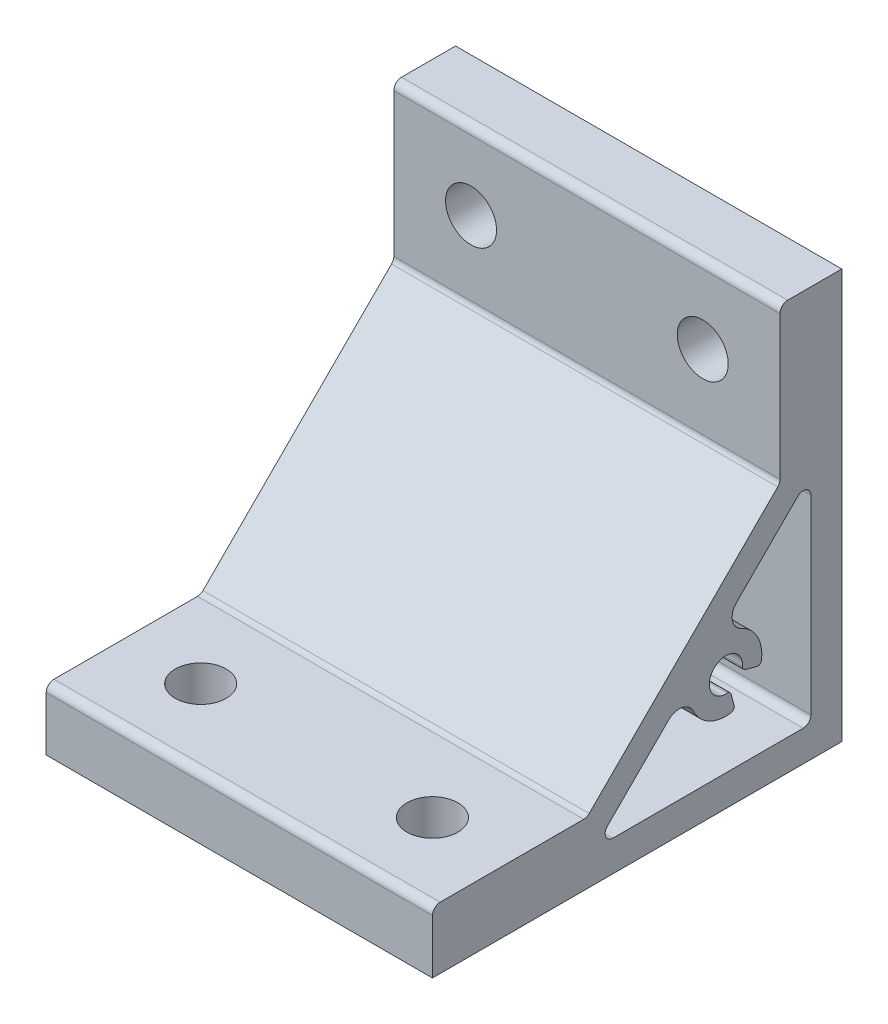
ISO-10303-21;
HEADER;
FILE_DESCRIPTION(('STEP AP214'),'2;1');
FILE_NAME('part.step','',(''),(''),'','','');
FILE_SCHEMA(('AUTOMOTIVE_DESIGN { 1 0 10303 214 1 1 1 1 }'));
ENDSEC;
DATA;
#1=APPLICATION_CONTEXT('core data for automotive mechanical design processes');
#2=APPLICATION_PROTOCOL_DEFINITION('international standard','automotive_design',2000,#1);
#3=PRODUCT_CONTEXT('',#1,'mechanical');
#4=PRODUCT('Part','Part','',(#3));
#5=PRODUCT_RELATED_PRODUCT_CATEGORY('part','',(#4));
#6=PRODUCT_DEFINITION_FORMATION('','',#4);
#7=PRODUCT_DEFINITION_CONTEXT('part definition',#1,'design');
#8=PRODUCT_DEFINITION('design','',#6,#7);
#9=PRODUCT_DEFINITION_SHAPE('','',#8);
#10=(LENGTH_UNIT() NAMED_UNIT(*) SI_UNIT(.MILLI.,.METRE.));
#11=(NAMED_UNIT(*) PLANE_ANGLE_UNIT() SI_UNIT($,.RADIAN.));
#12=(NAMED_UNIT(*) SI_UNIT($,.STERADIAN.) SOLID_ANGLE_UNIT());
#13=UNCERTAINTY_MEASURE_WITH_UNIT(LENGTH_MEASURE(1.E-05),#10,'distance_accuracy_value','');
#14=(GEOMETRIC_REPRESENTATION_CONTEXT(3) GLOBAL_UNCERTAINTY_ASSIGNED_CONTEXT((#13)) GLOBAL_UNIT_ASSIGNED_CONTEXT((#10,
#11,#12)) REPRESENTATION_CONTEXT('',''));
#15=CARTESIAN_POINT('',(0.,0.,0.));
#16=DIRECTION('',(0.,0.,1.));
#17=DIRECTION('',(1.,0.,0.));
#18=AXIS2_PLACEMENT_3D('',#15,#16,#17);
#19=CARTESIAN_POINT('',(25.,9.,33.4142135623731));
#20=DIRECTION('',(1.,0.,0.));
#21=DIRECTION('',(0.,0.,-1.));
#22=AXIS2_PLACEMENT_3D('',#19,#20,#21);
#23=PLANE('',#22);
#24=CARTESIAN_POINT('',(25.,9.,33.4142135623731));
#25=DIRECTION('',(-1.,0.,0.));
#26=DIRECTION('',(0.,0.,-1.));
#27=AXIS2_PLACEMENT_3D('',#24,#25,#26);
#28=CIRCLE('',#27,1.);
#29=CARTESIAN_POINT('',(25.,8.29289321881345,32.7071067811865));
#30=VERTEX_POINT('',#29);
#31=CARTESIAN_POINT('',(25.,8.,33.4142135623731));
#32=VERTEX_POINT('',#31);
#33=EDGE_CURVE('E364',#30,#32,#28,.T.);
#34=ORIENTED_EDGE('',*,*,#33,.T.);
#35=DIRECTION('',(0.,0.,1.));
#36=VECTOR('',#35,1.);
#37=CARTESIAN_POINT('',(25.,8.,52.));
#38=LINE('',#37,#36);
#39=CARTESIAN_POINT('',(25.,8.,52.));
#40=VERTEX_POINT('',#39);
#41=EDGE_CURVE('E367',#32,#40,#38,.T.);
#42=ORIENTED_EDGE('',*,*,#41,.T.);
#43=CARTESIAN_POINT('',(25.,7.,52.));
#44=DIRECTION('',(1.,0.,0.));
#45=DIRECTION('',(0.,0.,-1.));
#46=AXIS2_PLACEMENT_3D('',#43,#44,#45);
#47=CIRCLE('',#46,0.999999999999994);
#48=CARTESIAN_POINT('',(25.,7.,53.));
#49=VERTEX_POINT('',#48);
#50=EDGE_CURVE('E370',#40,#49,#47,.T.);
#51=ORIENTED_EDGE('',*,*,#50,.T.);
#52=DIRECTION('',(0.,-1.,0.));
#53=VECTOR('',#52,1.);
#54=CARTESIAN_POINT('',(25.,0.,53.));
#55=LINE('',#54,#53);
#56=CARTESIAN_POINT('',(25.,0.,53.));
#57=VERTEX_POINT('',#56);
#58=EDGE_CURVE('E372',#49,#57,#55,.T.);
#59=ORIENTED_EDGE('',*,*,#58,.T.);
#60=DIRECTION('',(0.,0.,-1.));
#61=VECTOR('',#60,1.);
#62=CARTESIAN_POINT('',(25.,0.,53.));
#63=LINE('',#62,#61);
#64=CARTESIAN_POINT('',(25.,0.,0.));
#65=VERTEX_POINT('',#64);
#66=EDGE_CURVE('E374',#57,#65,#63,.T.);
#67=ORIENTED_EDGE('',*,*,#66,.T.);
#68=DIRECTION('',(0.,1.,0.));
#69=VECTOR('',#68,1.);
#70=CARTESIAN_POINT('',(25.,0.,0.));
#71=LINE('',#70,#69);
#72=CARTESIAN_POINT('',(25.,53.,0.));
#73=VERTEX_POINT('',#72);
#74=EDGE_CURVE('E376',#65,#73,#71,.T.);
#75=ORIENTED_EDGE('',*,*,#74,.T.);
#76=DIRECTION('',(0.,0.,1.));
#77=VECTOR('',#76,1.);
#78=CARTESIAN_POINT('',(25.,53.,6.99999999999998));
#79=LINE('',#78,#77);
#80=CARTESIAN_POINT('',(25.,53.,6.99999999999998));
#81=VERTEX_POINT('',#80);
#82=EDGE_CURVE('E378',#73,#81,#79,.T.);
#83=ORIENTED_EDGE('',*,*,#82,.T.);
#84=CARTESIAN_POINT('',(25.,52.,6.99999999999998));
#85=DIRECTION('',(1.,0.,0.));
#86=DIRECTION('',(0.,0.,-1.));
#87=AXIS2_PLACEMENT_3D('',#84,#85,#86);
#88=CIRCLE('',#87,1.);
#89=CARTESIAN_POINT('',(25.,52.,7.99999999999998));
#90=VERTEX_POINT('',#89);
#91=EDGE_CURVE('E380',#81,#90,#88,.T.);
#92=ORIENTED_EDGE('',*,*,#91,.T.);
#93=DIRECTION('',(0.,-1.,0.));
#94=VECTOR('',#93,1.);
#95=CARTESIAN_POINT('',(25.,33.4142135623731,7.99999999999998));
#96=LINE('',#95,#94);
#97=CARTESIAN_POINT('',(25.,33.4142135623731,7.99999999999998));
#98=VERTEX_POINT('',#97);
#99=EDGE_CURVE('E382',#90,#98,#96,.T.);
#100=ORIENTED_EDGE('',*,*,#99,.T.);
#101=CARTESIAN_POINT('',(25.,33.4142135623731,8.99999999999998));
#102=DIRECTION('',(-1.,0.,0.));
#103=DIRECTION('',(0.,0.,-1.));
#104=AXIS2_PLACEMENT_3D('',#101,#102,#103);
#105=CIRCLE('',#104,0.999999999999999);
#106=CARTESIAN_POINT('',(25.,32.7071067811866,8.29289321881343));
#107=VERTEX_POINT('',#106);
#108=EDGE_CURVE('E384',#98,#107,#105,.T.);
#109=ORIENTED_EDGE('',*,*,#108,.T.);
#110=DIRECTION('',(0.,-0.707106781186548,0.707106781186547));
#111=VECTOR('',#110,1.);
#112=CARTESIAN_POINT('',(25.,32.7071067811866,8.29289321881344));
#113=LINE('',#112,#111);
#114=EDGE_CURVE('E386',#107,#30,#113,.T.);
#115=ORIENTED_EDGE('',*,*,#114,.T.);
#116=EDGE_LOOP('',(#34,#42,#51,#59,#67,#75,#83,#92,#100,#109,#115));
#117=FACE_BOUND('',#116,.T.);
#118=DIRECTION('',(0.,-0.707106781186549,0.707106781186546));
#119=VECTOR('',#118,1.);
#120=CARTESIAN_POINT('',(25.,13.6074107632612,22.442841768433));
#121=LINE('',#120,#119);
#122=CARTESIAN_POINT('',(25.,13.6074107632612,22.442841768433));
#123=VERTEX_POINT('',#122);
#124=CARTESIAN_POINT('',(25.,5.70710678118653,30.3431457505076));
#125=VERTEX_POINT('',#124);
#126=EDGE_CURVE('E235',#123,#125,#121,.T.);
#127=ORIENTED_EDGE('',*,*,#126,.F.);
#128=CARTESIAN_POINT('',(25.,12.1931972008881,21.0286282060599));
#129=DIRECTION('',(1.,0.,0.));
#130=DIRECTION('',(0.,0.,-1.));
#131=AXIS2_PLACEMENT_3D('',#128,#129,#130);
#132=CIRCLE('',#131,2.00000000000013);
#133=CARTESIAN_POINT('',(25.,13.0373484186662,19.2155069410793));
#134=VERTEX_POINT('',#133);
#135=EDGE_CURVE('E227',#134,#123,#132,.T.);
#136=ORIENTED_EDGE('',*,*,#135,.F.);
#137=CARTESIAN_POINT('',(25.,15.,15.));
#138=DIRECTION('',(-1.,0.,0.));
#139=DIRECTION('',(0.,0.,-1.));
#140=AXIS2_PLACEMENT_3D('',#137,#138,#139);
#141=CIRCLE('',#140,4.65);
#142=CARTESIAN_POINT('',(25.,10.3961625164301,14.3464095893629));
#143=VERTEX_POINT('',#142);
#144=EDGE_CURVE('E281',#143,#134,#141,.T.);
#145=ORIENTED_EDGE('',*,*,#144,.F.);
#146=CARTESIAN_POINT('',(25.,10.891198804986,14.4166881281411));
#147=DIRECTION('',(-1.,0.,0.));
#148=DIRECTION('',(0.,0.,-1.));
#149=AXIS2_PLACEMENT_3D('',#146,#147,#148);
#150=CIRCLE('',#149,0.500000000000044);
#151=CARTESIAN_POINT('',(25.,11.0206083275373,13.9337252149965));
#152=VERTEX_POINT('',#151);
#153=EDGE_CURVE('E279',#152,#143,#150,.T.);
#154=ORIENTED_EDGE('',*,*,#153,.F.);
#155=DIRECTION('',(0.,-0.965925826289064,-0.258819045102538));
#156=VECTOR('',#155,1.);
#157=CARTESIAN_POINT('',(25.,11.0206083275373,13.9337252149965));
#158=LINE('',#157,#156);
#159=CARTESIAN_POINT('',(25.,12.4862719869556,14.3264486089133));
#160=VERTEX_POINT('',#159);
#161=EDGE_CURVE('E277',#160,#152,#158,.T.);
#162=ORIENTED_EDGE('',*,*,#161,.F.);
#163=CARTESIAN_POINT('',(25.,12.3568624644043,14.8094115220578));
#164=DIRECTION('',(-1.,0.,0.));
#165=DIRECTION('',(0.,0.,-1.));
#166=AXIS2_PLACEMENT_3D('',#163,#164,#165);
#167=CIRCLE('',#166,0.499999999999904);
#168=CARTESIAN_POINT('',(25.,12.8555676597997,14.8453716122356));
#169=VERTEX_POINT('',#168);
#170=EDGE_CURVE('E275',#169,#160,#167,.T.);
#171=ORIENTED_EDGE('',*,*,#170,.F.);
#172=CARTESIAN_POINT('',(25.,15.,15.));
#173=DIRECTION('',(1.,0.,0.));
#174=DIRECTION('',(0.,0.,-1.));
#175=AXIS2_PLACEMENT_3D('',#172,#173,#174);
#176=CIRCLE('',#175,2.15);
#177=CARTESIAN_POINT('',(25.,14.8453716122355,12.8555676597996));
#178=VERTEX_POINT('',#177);
#179=EDGE_CURVE('E273',#178,#169,#176,.T.);
#180=ORIENTED_EDGE('',*,*,#179,.F.);
#181=CARTESIAN_POINT('',(25.,14.8094115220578,12.3568624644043));
#182=DIRECTION('',(-1.,0.,0.));
#183=DIRECTION('',(0.,0.,-1.));
#184=AXIS2_PLACEMENT_3D('',#181,#182,#183);
#185=CIRCLE('',#184,0.499999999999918);
#186=CARTESIAN_POINT('',(25.,14.3264486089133,12.4862719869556));
#187=VERTEX_POINT('',#186);
#188=EDGE_CURVE('E271',#187,#178,#185,.T.);
#189=ORIENTED_EDGE('',*,*,#188,.F.);
#190=DIRECTION('',(0.,0.258819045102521,0.965925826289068));
#191=VECTOR('',#190,1.);
#192=CARTESIAN_POINT('',(25.,13.9337252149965,11.0206083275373));
#193=LINE('',#192,#191);
#194=CARTESIAN_POINT('',(25.,13.9337252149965,11.0206083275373));
#195=VERTEX_POINT('',#194);
#196=EDGE_CURVE('E269',#195,#187,#193,.T.);
#197=ORIENTED_EDGE('',*,*,#196,.F.);
#198=CARTESIAN_POINT('',(25.,14.416688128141,10.891198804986));
#199=DIRECTION('',(-1.,0.,0.));
#200=DIRECTION('',(0.,0.,-1.));
#201=AXIS2_PLACEMENT_3D('',#198,#199,#200);
#202=CIRCLE('',#201,0.499999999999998);
#203=CARTESIAN_POINT('',(25.,14.3464095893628,10.3961625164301));
#204=VERTEX_POINT('',#203);
#205=EDGE_CURVE('E267',#204,#195,#202,.T.);
#206=ORIENTED_EDGE('',*,*,#205,.F.);
#207=CARTESIAN_POINT('',(25.,15.,15.));
#208=DIRECTION('',(-1.,0.,0.));
#209=DIRECTION('',(0.,0.,-1.));
#210=AXIS2_PLACEMENT_3D('',#207,#208,#209);
#211=CIRCLE('',#210,4.65000000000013);
#212=CARTESIAN_POINT('',(25.,19.2155069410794,13.0373484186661));
#213=VERTEX_POINT('',#212);
#214=EDGE_CURVE('E265',#213,#204,#211,.T.);
#215=ORIENTED_EDGE('',*,*,#214,.F.);
#216=CARTESIAN_POINT('',(25.,21.0286282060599,12.1931972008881));
#217=DIRECTION('',(1.,0.,0.));
#218=DIRECTION('',(0.,0.,-1.));
#219=AXIS2_PLACEMENT_3D('',#216,#217,#218);
#220=CIRCLE('',#219,1.99999999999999);
#221=CARTESIAN_POINT('',(25.,22.442841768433,13.6074107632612));
#222=VERTEX_POINT('',#221);
#223=EDGE_CURVE('E263',#222,#213,#220,.T.);
#224=ORIENTED_EDGE('',*,*,#223,.F.);
#225=DIRECTION('',(0.,-0.707106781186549,0.707106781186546));
#226=VECTOR('',#225,1.);
#227=CARTESIAN_POINT('',(25.,30.3431457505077,5.70710678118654));
#228=LINE('',#227,#226);
#229=CARTESIAN_POINT('',(25.,30.3431457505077,5.70710678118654));
#230=VERTEX_POINT('',#229);
#231=EDGE_CURVE('E261',#230,#222,#228,.T.);
#232=ORIENTED_EDGE('',*,*,#231,.F.);
#233=CARTESIAN_POINT('',(25.,29.6360389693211,4.99999999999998));
#234=DIRECTION('',(1.,0.,0.));
#235=DIRECTION('',(0.,0.,-1.));
#236=AXIS2_PLACEMENT_3D('',#233,#234,#235);
#237=CIRCLE('',#236,1.00000000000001);
#238=CARTESIAN_POINT('',(25.,29.6360389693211,3.99999999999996));
#239=VERTEX_POINT('',#238);
#240=EDGE_CURVE('E259',#239,#230,#237,.T.);
#241=ORIENTED_EDGE('',*,*,#240,.F.);
#242=DIRECTION('',(0.,1.,0.));
#243=VECTOR('',#242,1.);
#244=CARTESIAN_POINT('',(25.,4.99999999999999,3.99999999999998));
#245=LINE('',#244,#243);
#246=CARTESIAN_POINT('',(25.,4.99999999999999,3.99999999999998));
#247=VERTEX_POINT('',#246);
#248=EDGE_CURVE('E257',#247,#239,#245,.T.);
#249=ORIENTED_EDGE('',*,*,#248,.F.);
#250=CARTESIAN_POINT('',(25.,4.99999999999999,4.99999999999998));
#251=DIRECTION('',(1.,0.,0.));
#252=DIRECTION('',(0.,0.,-1.));
#253=AXIS2_PLACEMENT_3D('',#250,#251,#252);
#254=CIRCLE('',#253,1.);
#255=CARTESIAN_POINT('',(25.,3.99999999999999,4.99999999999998));
#256=VERTEX_POINT('',#255);
#257=EDGE_CURVE('E255',#256,#247,#254,.T.);
#258=ORIENTED_EDGE('',*,*,#257,.F.);
#259=DIRECTION('',(0.,0.,-1.));
#260=VECTOR('',#259,1.);
#261=CARTESIAN_POINT('',(25.,3.99999999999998,29.6360389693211));
#262=LINE('',#261,#260);
#263=CARTESIAN_POINT('',(25.,3.99999999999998,29.6360389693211));
#264=VERTEX_POINT('',#263);
#265=EDGE_CURVE('E250',#264,#256,#262,.T.);
#266=ORIENTED_EDGE('',*,*,#265,.F.);
#267=CARTESIAN_POINT('',(25.,4.99999999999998,29.6360389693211));
#268=DIRECTION('',(1.,0.,0.));
#269=DIRECTION('',(0.,0.,-1.));
#270=AXIS2_PLACEMENT_3D('',#267,#268,#269);
#271=CIRCLE('',#270,0.999999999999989);
#272=EDGE_CURVE('E248',#125,#264,#271,.T.);
#273=ORIENTED_EDGE('',*,*,#272,.F.);
#274=EDGE_LOOP('',(#127,#136,#145,#154,#162,#171,#180,#189,#197,#206,#215,#224,#232,#241,#249,
#258,#266,#273));
#275=FACE_BOUND('',#274,.T.);
#276=ADVANCED_FACE('F36',(#117,#275),#23,.T.);
#277=CARTESIAN_POINT('',(-25.,9.,33.4142135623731));
#278=DIRECTION('',(1.,0.,0.));
#279=DIRECTION('',(0.,0.,-1.));
#280=AXIS2_PLACEMENT_3D('',#277,#278,#279);
#281=PLANE('',#280);
#282=CARTESIAN_POINT('',(-25.,9.,33.4142135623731));
#283=DIRECTION('',(-1.,0.,0.));
#284=DIRECTION('',(0.,0.,-1.));
#285=AXIS2_PLACEMENT_3D('',#282,#283,#284);
#286=CIRCLE('',#285,1.);
#287=CARTESIAN_POINT('',(-25.,8.29289321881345,32.7071067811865));
#288=VERTEX_POINT('',#287);
#289=CARTESIAN_POINT('',(-25.,8.,33.4142135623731));
#290=VERTEX_POINT('',#289);
#291=EDGE_CURVE('E243',#288,#290,#286,.T.);
#292=ORIENTED_EDGE('',*,*,#291,.F.);
#293=DIRECTION('',(0.,-0.707106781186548,0.707106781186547));
#294=VECTOR('',#293,1.);
#295=CARTESIAN_POINT('',(-25.,32.7071067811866,8.29289321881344));
#296=LINE('',#295,#294);
#297=CARTESIAN_POINT('',(-25.,32.7071067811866,8.29289321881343));
#298=VERTEX_POINT('',#297);
#299=EDGE_CURVE('E368',#298,#288,#296,.T.);
#300=ORIENTED_EDGE('',*,*,#299,.F.);
#301=CARTESIAN_POINT('',(-25.,33.4142135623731,8.99999999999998));
#302=DIRECTION('',(-1.,0.,0.));
#303=DIRECTION('',(0.,0.,-1.));
#304=AXIS2_PLACEMENT_3D('',#301,#302,#303);
#305=CIRCLE('',#304,0.999999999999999);
#306=CARTESIAN_POINT('',(-25.,33.4142135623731,7.99999999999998));
#307=VERTEX_POINT('',#306);
#308=EDGE_CURVE('E407',#307,#298,#305,.T.);
#309=ORIENTED_EDGE('',*,*,#308,.F.);
#310=DIRECTION('',(0.,-1.,0.));
#311=VECTOR('',#310,1.);
#312=CARTESIAN_POINT('',(-25.,33.4142135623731,7.99999999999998));
#313=LINE('',#312,#311);
#314=CARTESIAN_POINT('',(-25.,52.,7.99999999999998));
#315=VERTEX_POINT('',#314);
#316=EDGE_CURVE('E405',#315,#307,#313,.T.);
#317=ORIENTED_EDGE('',*,*,#316,.F.);
#318=CARTESIAN_POINT('',(-25.,52.,6.99999999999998));
#319=DIRECTION('',(1.,0.,0.));
#320=DIRECTION('',(0.,0.,-1.));
#321=AXIS2_PLACEMENT_3D('',#318,#319,#320);
#322=CIRCLE('',#321,1.);
#323=CARTESIAN_POINT('',(-25.,53.,6.99999999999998));
#324=VERTEX_POINT('',#323);
#325=EDGE_CURVE('E403',#324,#315,#322,.T.);
#326=ORIENTED_EDGE('',*,*,#325,.F.);
#327=DIRECTION('',(0.,0.,1.));
#328=VECTOR('',#327,1.);
#329=CARTESIAN_POINT('',(-25.,53.,6.99999999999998));
#330=LINE('',#329,#328);
#331=CARTESIAN_POINT('',(-25.,53.,0.));
#332=VERTEX_POINT('',#331);
#333=EDGE_CURVE('E401',#332,#324,#330,.T.);
#334=ORIENTED_EDGE('',*,*,#333,.F.);
#335=DIRECTION('',(0.,1.,0.));
#336=VECTOR('',#335,1.);
#337=CARTESIAN_POINT('',(-25.,0.,0.));
#338=LINE('',#337,#336);
#339=CARTESIAN_POINT('',(-25.,0.,0.));
#340=VERTEX_POINT('',#339);
#341=EDGE_CURVE('E399',#340,#332,#338,.T.);
#342=ORIENTED_EDGE('',*,*,#341,.F.);
#343=DIRECTION('',(0.,0.,-1.));
#344=VECTOR('',#343,1.);
#345=CARTESIAN_POINT('',(-25.,0.,53.));
#346=LINE('',#345,#344);
#347=CARTESIAN_POINT('',(-25.,0.,53.));
#348=VERTEX_POINT('',#347);
#349=EDGE_CURVE('E397',#348,#340,#346,.T.);
#350=ORIENTED_EDGE('',*,*,#349,.F.);
#351=DIRECTION('',(0.,-1.,0.));
#352=VECTOR('',#351,1.);
#353=CARTESIAN_POINT('',(-25.,0.,53.));
#354=LINE('',#353,#352);
#355=CARTESIAN_POINT('',(-25.,7.,53.));
#356=VERTEX_POINT('',#355);
#357=EDGE_CURVE('E395',#356,#348,#354,.T.);
#358=ORIENTED_EDGE('',*,*,#357,.F.);
#359=CARTESIAN_POINT('',(-25.,7.,52.));
#360=DIRECTION('',(1.,0.,0.));
#361=DIRECTION('',(0.,0.,-1.));
#362=AXIS2_PLACEMENT_3D('',#359,#360,#361);
#363=CIRCLE('',#362,0.999999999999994);
#364=CARTESIAN_POINT('',(-25.,8.,52.));
#365=VERTEX_POINT('',#364);
#366=EDGE_CURVE('E393',#365,#356,#363,.T.);
#367=ORIENTED_EDGE('',*,*,#366,.F.);
#368=DIRECTION('',(0.,0.,1.));
#369=VECTOR('',#368,1.);
#370=CARTESIAN_POINT('',(-25.,8.,52.));
#371=LINE('',#370,#369);
#372=EDGE_CURVE('E391',#290,#365,#371,.T.);
#373=ORIENTED_EDGE('',*,*,#372,.F.);
#374=EDGE_LOOP('',(#292,#300,#309,#317,#326,#334,#342,#350,#358,#367,#373));
#375=FACE_BOUND('',#374,.T.);
#376=CARTESIAN_POINT('',(-25.,12.1931972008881,21.0286282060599));
#377=DIRECTION('',(1.,0.,0.));
#378=DIRECTION('',(0.,0.,-1.));
#379=AXIS2_PLACEMENT_3D('',#376,#377,#378);
#380=CIRCLE('',#379,2.00000000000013);
#381=CARTESIAN_POINT('',(-25.,13.0373484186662,19.2155069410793));
#382=VERTEX_POINT('',#381);
#383=CARTESIAN_POINT('',(-25.,13.6074107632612,22.442841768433));
#384=VERTEX_POINT('',#383);
#385=EDGE_CURVE('E59',#382,#384,#380,.T.);
#386=ORIENTED_EDGE('',*,*,#385,.T.);
#387=DIRECTION('',(0.,-0.707106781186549,0.707106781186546));
#388=VECTOR('',#387,1.);
#389=CARTESIAN_POINT('',(-25.,13.6074107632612,22.442841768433));
#390=LINE('',#389,#388);
#391=CARTESIAN_POINT('',(-25.,5.70710678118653,30.3431457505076));
#392=VERTEX_POINT('',#391);
#393=EDGE_CURVE('E242',#384,#392,#390,.T.);
#394=ORIENTED_EDGE('',*,*,#393,.T.);
#395=CARTESIAN_POINT('',(-25.,4.99999999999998,29.6360389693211));
#396=DIRECTION('',(1.,0.,0.));
#397=DIRECTION('',(0.,0.,-1.));
#398=AXIS2_PLACEMENT_3D('',#395,#396,#397);
#399=CIRCLE('',#398,0.999999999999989);
#400=CARTESIAN_POINT('',(-25.,3.99999999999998,29.6360389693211));
#401=VERTEX_POINT('',#400);
#402=EDGE_CURVE('E286',#392,#401,#399,.T.);
#403=ORIENTED_EDGE('',*,*,#402,.T.);
#404=DIRECTION('',(0.,0.,-1.));
#405=VECTOR('',#404,1.);
#406=CARTESIAN_POINT('',(-25.,3.99999999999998,29.6360389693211));
#407=LINE('',#406,#405);
#408=CARTESIAN_POINT('',(-25.,3.99999999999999,4.99999999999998));
#409=VERTEX_POINT('',#408);
#410=EDGE_CURVE('E289',#401,#409,#407,.T.);
#411=ORIENTED_EDGE('',*,*,#410,.T.);
#412=CARTESIAN_POINT('',(-25.,4.99999999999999,4.99999999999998));
#413=DIRECTION('',(1.,0.,0.));
#414=DIRECTION('',(0.,0.,-1.));
#415=AXIS2_PLACEMENT_3D('',#412,#413,#414);
#416=CIRCLE('',#415,1.);
#417=CARTESIAN_POINT('',(-25.,4.99999999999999,3.99999999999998));
#418=VERTEX_POINT('',#417);
#419=EDGE_CURVE('E292',#409,#418,#416,.T.);
#420=ORIENTED_EDGE('',*,*,#419,.T.);
#421=DIRECTION('',(0.,1.,0.));
#422=VECTOR('',#421,1.);
#423=CARTESIAN_POINT('',(-25.,4.99999999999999,3.99999999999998));
#424=LINE('',#423,#422);
#425=CARTESIAN_POINT('',(-25.,29.6360389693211,3.99999999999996));
#426=VERTEX_POINT('',#425);
#427=EDGE_CURVE('E295',#418,#426,#424,.T.);
#428=ORIENTED_EDGE('',*,*,#427,.T.);
#429=CARTESIAN_POINT('',(-25.,29.6360389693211,4.99999999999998));
#430=DIRECTION('',(1.,0.,0.));
#431=DIRECTION('',(0.,0.,-1.));
#432=AXIS2_PLACEMENT_3D('',#429,#430,#431);
#433=CIRCLE('',#432,1.00000000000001);
#434=CARTESIAN_POINT('',(-25.,30.3431457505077,5.70710678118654));
#435=VERTEX_POINT('',#434);
#436=EDGE_CURVE('E298',#426,#435,#433,.T.);
#437=ORIENTED_EDGE('',*,*,#436,.T.);
#438=DIRECTION('',(0.,-0.707106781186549,0.707106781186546));
#439=VECTOR('',#438,1.);
#440=CARTESIAN_POINT('',(-25.,30.3431457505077,5.70710678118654));
#441=LINE('',#440,#439);
#442=CARTESIAN_POINT('',(-25.,22.442841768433,13.6074107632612));
#443=VERTEX_POINT('',#442);
#444=EDGE_CURVE('E301',#435,#443,#441,.T.);
#445=ORIENTED_EDGE('',*,*,#444,.T.);
#446=CARTESIAN_POINT('',(-25.,21.0286282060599,12.1931972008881));
#447=DIRECTION('',(1.,0.,0.));
#448=DIRECTION('',(0.,0.,-1.));
#449=AXIS2_PLACEMENT_3D('',#446,#447,#448);
#450=CIRCLE('',#449,1.99999999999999);
#451=CARTESIAN_POINT('',(-25.,19.2155069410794,13.0373484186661));
#452=VERTEX_POINT('',#451);
#453=EDGE_CURVE('E304',#443,#452,#450,.T.);
#454=ORIENTED_EDGE('',*,*,#453,.T.);
#455=CARTESIAN_POINT('',(-25.,15.,15.));
#456=DIRECTION('',(-1.,0.,0.));
#457=DIRECTION('',(0.,0.,-1.));
#458=AXIS2_PLACEMENT_3D('',#455,#456,#457);
#459=CIRCLE('',#458,4.65000000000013);
#460=CARTESIAN_POINT('',(-25.,14.3464095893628,10.3961625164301));
#461=VERTEX_POINT('',#460);
#462=EDGE_CURVE('E307',#452,#461,#459,.T.);
#463=ORIENTED_EDGE('',*,*,#462,.T.);
#464=CARTESIAN_POINT('',(-25.,14.416688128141,10.891198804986));
#465=DIRECTION('',(-1.,0.,0.));
#466=DIRECTION('',(0.,0.,-1.));
#467=AXIS2_PLACEMENT_3D('',#464,#465,#466);
#468=CIRCLE('',#467,0.499999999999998);
#469=CARTESIAN_POINT('',(-25.,13.9337252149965,11.0206083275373));
#470=VERTEX_POINT('',#469);
#471=EDGE_CURVE('E310',#461,#470,#468,.T.);
#472=ORIENTED_EDGE('',*,*,#471,.T.);
#473=DIRECTION('',(0.,0.258819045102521,0.965925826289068));
#474=VECTOR('',#473,1.);
#475=CARTESIAN_POINT('',(-25.,13.9337252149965,11.0206083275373));
#476=LINE('',#475,#474);
#477=CARTESIAN_POINT('',(-25.,14.3264486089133,12.4862719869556));
#478=VERTEX_POINT('',#477);
#479=EDGE_CURVE('E313',#470,#478,#476,.T.);
#480=ORIENTED_EDGE('',*,*,#479,.T.);
#481=CARTESIAN_POINT('',(-25.,14.8094115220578,12.3568624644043));
#482=DIRECTION('',(-1.,0.,0.));
#483=DIRECTION('',(0.,0.,-1.));
#484=AXIS2_PLACEMENT_3D('',#481,#482,#483);
#485=CIRCLE('',#484,0.499999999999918);
#486=CARTESIAN_POINT('',(-25.,14.8453716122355,12.8555676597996));
#487=VERTEX_POINT('',#486);
#488=EDGE_CURVE('E316',#478,#487,#485,.T.);
#489=ORIENTED_EDGE('',*,*,#488,.T.);
#490=CARTESIAN_POINT('',(-25.,15.,15.));
#491=DIRECTION('',(1.,0.,0.));
#492=DIRECTION('',(0.,0.,-1.));
#493=AXIS2_PLACEMENT_3D('',#490,#491,#492);
#494=CIRCLE('',#493,2.15);
#495=CARTESIAN_POINT('',(-25.,12.8555676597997,14.8453716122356));
#496=VERTEX_POINT('',#495);
#497=EDGE_CURVE('E319',#487,#496,#494,.T.);
#498=ORIENTED_EDGE('',*,*,#497,.T.);
#499=CARTESIAN_POINT('',(-25.,12.3568624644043,14.8094115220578));
#500=DIRECTION('',(-1.,0.,0.));
#501=DIRECTION('',(0.,0.,-1.));
#502=AXIS2_PLACEMENT_3D('',#499,#500,#501);
#503=CIRCLE('',#502,0.499999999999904);
#504=CARTESIAN_POINT('',(-25.,12.4862719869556,14.3264486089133));
#505=VERTEX_POINT('',#504);
#506=EDGE_CURVE('E322',#496,#505,#503,.T.);
#507=ORIENTED_EDGE('',*,*,#506,.T.);
#508=DIRECTION('',(0.,-0.965925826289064,-0.258819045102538));
#509=VECTOR('',#508,1.);
#510=CARTESIAN_POINT('',(-25.,11.0206083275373,13.9337252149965));
#511=LINE('',#510,#509);
#512=CARTESIAN_POINT('',(-25.,11.0206083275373,13.9337252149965));
#513=VERTEX_POINT('',#512);
#514=EDGE_CURVE('E325',#505,#513,#511,.T.);
#515=ORIENTED_EDGE('',*,*,#514,.T.);
#516=CARTESIAN_POINT('',(-25.,10.891198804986,14.4166881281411));
#517=DIRECTION('',(-1.,0.,0.));
#518=DIRECTION('',(0.,0.,-1.));
#519=AXIS2_PLACEMENT_3D('',#516,#517,#518);
#520=CIRCLE('',#519,0.500000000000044);
#521=CARTESIAN_POINT('',(-25.,10.3961625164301,14.3464095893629));
#522=VERTEX_POINT('',#521);
#523=EDGE_CURVE('E328',#513,#522,#520,.T.);
#524=ORIENTED_EDGE('',*,*,#523,.T.);
#525=CARTESIAN_POINT('',(-25.,15.,15.));
#526=DIRECTION('',(-1.,0.,0.));
#527=DIRECTION('',(0.,0.,-1.));
#528=AXIS2_PLACEMENT_3D('',#525,#526,#527);
#529=CIRCLE('',#528,4.65);
#530=EDGE_CURVE('E236',#522,#382,#529,.T.);
#531=ORIENTED_EDGE('',*,*,#530,.T.);
#532=EDGE_LOOP('',(#386,#394,#403,#411,#420,#428,#437,#445,#454,#463,#472,#480,#489,#498,#507,
#515,#524,#531));
#533=FACE_BOUND('',#532,.T.);
#534=ADVANCED_FACE('F446',(#375,#533),#281,.F.);
#535=CARTESIAN_POINT('',(25.,9.,33.4142135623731));
#536=DIRECTION('',(-1.,0.,0.));
#537=DIRECTION('',(0.,0.,1.));
#538=AXIS2_PLACEMENT_3D('',#535,#536,#537);
#539=CYLINDRICAL_SURFACE('',#538,1.);
#540=ORIENTED_EDGE('',*,*,#291,.T.);
#541=DIRECTION('',(-1.,0.,0.));
#542=VECTOR('',#541,1.);
#543=CARTESIAN_POINT('',(25.,8.,33.4142135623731));
#544=LINE('',#543,#542);
#545=EDGE_CURVE('E11',#32,#290,#544,.T.);
#546=ORIENTED_EDGE('',*,*,#545,.F.);
#547=ORIENTED_EDGE('',*,*,#33,.F.);
#548=DIRECTION('',(-1.,0.,0.));
#549=VECTOR('',#548,1.);
#550=CARTESIAN_POINT('',(25.,8.29289321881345,32.7071067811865));
#551=LINE('',#550,#549);
#552=EDGE_CURVE('E388',#30,#288,#551,.T.);
#553=ORIENTED_EDGE('',*,*,#552,.T.);
#554=EDGE_LOOP('',(#540,#546,#547,#553));
#555=FACE_BOUND('',#554,.T.);
#556=ADVANCED_FACE('F38',(#555),#539,.F.);
#557=CARTESIAN_POINT('',(25.,8.,52.));
#558=DIRECTION('',(0.,-1.,0.));
#559=DIRECTION('',(0.,0.,-1.));
#560=AXIS2_PLACEMENT_3D('',#557,#558,#559);
#561=PLANE('',#560);
#562=CARTESIAN_POINT('',(-15.,8.,43.));
#563=DIRECTION('',(0.,1.,0.));
#564=DIRECTION('',(0.,0.,1.));
#565=AXIS2_PLACEMENT_3D('',#562,#563,#564);
#566=CIRCLE('',#565,3.3);
#567=CARTESIAN_POINT('',(-15.,8.,46.3));
#568=VERTEX_POINT('',#567);
#569=EDGE_CURVE('E818',#568,#568,#566,.T.);
#570=ORIENTED_EDGE('',*,*,#569,.F.);
#571=EDGE_LOOP('',(#570));
#572=FACE_BOUND('',#571,.T.);
#573=CARTESIAN_POINT('',(15.,8.,43.));
#574=DIRECTION('',(0.,1.,0.));
#575=DIRECTION('',(0.,0.,1.));
#576=AXIS2_PLACEMENT_3D('',#573,#574,#575);
#577=CIRCLE('',#576,3.3);
#578=CARTESIAN_POINT('',(15.,8.,46.3));
#579=VERTEX_POINT('',#578);
#580=EDGE_CURVE('E821',#579,#579,#577,.T.);
#581=ORIENTED_EDGE('',*,*,#580,.F.);
#582=EDGE_LOOP('',(#581));
#583=FACE_BOUND('',#582,.T.);
#584=ORIENTED_EDGE('',*,*,#372,.T.);
#585=DIRECTION('',(-1.,0.,0.));
#586=VECTOR('',#585,1.);
#587=CARTESIAN_POINT('',(25.,8.,52.));
#588=LINE('',#587,#586);
#589=EDGE_CURVE('E44',#40,#365,#588,.T.);
#590=ORIENTED_EDGE('',*,*,#589,.F.);
#591=ORIENTED_EDGE('',*,*,#41,.F.);
#592=ORIENTED_EDGE('',*,*,#545,.T.);
#593=EDGE_LOOP('',(#584,#590,#591,#592));
#594=FACE_BOUND('',#593,.T.);
#595=ADVANCED_FACE('F463',(#572,#583,#594),#561,.F.);
#596=CARTESIAN_POINT('',(25.,7.,52.));
#597=DIRECTION('',(-1.,0.,0.));
#598=DIRECTION('',(0.,0.,1.));
#599=AXIS2_PLACEMENT_3D('',#596,#597,#598);
#600=CYLINDRICAL_SURFACE('',#599,0.999999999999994);
#601=ORIENTED_EDGE('',*,*,#366,.T.);
#602=DIRECTION('',(-1.,0.,0.));
#603=VECTOR('',#602,1.);
#604=CARTESIAN_POINT('',(25.,7.,53.));
#605=LINE('',#604,#603);
#606=EDGE_CURVE('E433',#49,#356,#605,.T.);
#607=ORIENTED_EDGE('',*,*,#606,.F.);
#608=ORIENTED_EDGE('',*,*,#50,.F.);
#609=ORIENTED_EDGE('',*,*,#589,.T.);
#610=EDGE_LOOP('',(#601,#607,#608,#609));
#611=FACE_BOUND('',#610,.T.);
#612=ADVANCED_FACE('F440',(#611),#600,.T.);
#613=CARTESIAN_POINT('',(25.,0.,53.));
#614=DIRECTION('',(0.,0.,-1.));
#615=DIRECTION('',(-1.,0.,0.));
#616=AXIS2_PLACEMENT_3D('',#613,#614,#615);
#617=PLANE('',#616);
#618=ORIENTED_EDGE('',*,*,#357,.T.);
#619=DIRECTION('',(-1.,0.,0.));
#620=VECTOR('',#619,1.);
#621=CARTESIAN_POINT('',(25.,0.,53.));
#622=LINE('',#621,#620);
#623=EDGE_CURVE('E430',#57,#348,#622,.T.);
#624=ORIENTED_EDGE('',*,*,#623,.F.);
#625=ORIENTED_EDGE('',*,*,#58,.F.);
#626=ORIENTED_EDGE('',*,*,#606,.T.);
#627=EDGE_LOOP('',(#618,#624,#625,#626));
#628=FACE_BOUND('',#627,.T.);
#629=ADVANCED_FACE('F452',(#628),#617,.F.);
#630=CARTESIAN_POINT('',(25.,0.,53.));
#631=DIRECTION('',(0.,1.,0.));
#632=DIRECTION('',(0.,0.,1.));
#633=AXIS2_PLACEMENT_3D('',#630,#631,#632);
#634=PLANE('',#633);
#635=CARTESIAN_POINT('',(-15.,0.,43.));
#636=DIRECTION('',(0.,1.,0.));
#637=DIRECTION('',(0.,0.,1.));
#638=AXIS2_PLACEMENT_3D('',#635,#636,#637);
#639=CIRCLE('',#638,3.3);
#640=CARTESIAN_POINT('',(-15.,0.,46.3));
#641=VERTEX_POINT('',#640);
#642=EDGE_CURVE('E824',#641,#641,#639,.T.);
#643=ORIENTED_EDGE('',*,*,#642,.T.);
#644=EDGE_LOOP('',(#643));
#645=FACE_BOUND('',#644,.T.);
#646=CARTESIAN_POINT('',(15.,0.,43.));
#647=DIRECTION('',(0.,1.,0.));
#648=DIRECTION('',(0.,0.,1.));
#649=AXIS2_PLACEMENT_3D('',#646,#647,#648);
#650=CIRCLE('',#649,3.3);
#651=CARTESIAN_POINT('',(15.,0.,46.3));
#652=VERTEX_POINT('',#651);
#653=EDGE_CURVE('E823',#652,#652,#650,.T.);
#654=ORIENTED_EDGE('',*,*,#653,.T.);
#655=EDGE_LOOP('',(#654));
#656=FACE_BOUND('',#655,.T.);
#657=ORIENTED_EDGE('',*,*,#349,.T.);
#658=DIRECTION('',(-1.,0.,0.));
#659=VECTOR('',#658,1.);
#660=CARTESIAN_POINT('',(25.,0.,0.));
#661=LINE('',#660,#659);
#662=EDGE_CURVE('E427',#65,#340,#661,.T.);
#663=ORIENTED_EDGE('',*,*,#662,.F.);
#664=ORIENTED_EDGE('',*,*,#66,.F.);
#665=ORIENTED_EDGE('',*,*,#623,.T.);
#666=EDGE_LOOP('',(#657,#663,#664,#665));
#667=FACE_BOUND('',#666,.T.);
#668=ADVANCED_FACE('F456',(#645,#656,#667),#634,.F.);
#669=CARTESIAN_POINT('',(25.,0.,0.));
#670=DIRECTION('',(0.,0.,1.));
#671=DIRECTION('',(1.,0.,0.));
#672=AXIS2_PLACEMENT_3D('',#669,#670,#671);
#673=PLANE('',#672);
#674=CARTESIAN_POINT('',(-15.,42.9999999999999,0.));
#675=DIRECTION('',(0.,0.,1.));
#676=DIRECTION('',(1.,0.,0.));
#677=AXIS2_PLACEMENT_3D('',#674,#675,#676);
#678=CIRCLE('',#677,3.3);
#679=CARTESIAN_POINT('',(-11.7,42.9999999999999,0.));
#680=VERTEX_POINT('',#679);
#681=EDGE_CURVE('E833',#680,#680,#678,.T.);
#682=ORIENTED_EDGE('',*,*,#681,.T.);
#683=EDGE_LOOP('',(#682));
#684=FACE_BOUND('',#683,.T.);
#685=CARTESIAN_POINT('',(15.,42.9999999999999,0.));
#686=DIRECTION('',(0.,0.,1.));
#687=DIRECTION('',(1.,0.,0.));
#688=AXIS2_PLACEMENT_3D('',#685,#686,#687);
#689=CIRCLE('',#688,3.3);
#690=CARTESIAN_POINT('',(18.3,42.9999999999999,0.));
#691=VERTEX_POINT('',#690);
#692=EDGE_CURVE('E284',#691,#691,#689,.T.);
#693=ORIENTED_EDGE('',*,*,#692,.T.);
#694=EDGE_LOOP('',(#693));
#695=FACE_BOUND('',#694,.T.);
#696=ORIENTED_EDGE('',*,*,#341,.T.);
#697=DIRECTION('',(-1.,0.,0.));
#698=VECTOR('',#697,1.);
#699=CARTESIAN_POINT('',(25.,53.,0.));
#700=LINE('',#699,#698);
#701=EDGE_CURVE('E424',#73,#332,#700,.T.);
#702=ORIENTED_EDGE('',*,*,#701,.F.);
#703=ORIENTED_EDGE('',*,*,#74,.F.);
#704=ORIENTED_EDGE('',*,*,#662,.T.);
#705=EDGE_LOOP('',(#696,#702,#703,#704));
#706=FACE_BOUND('',#705,.T.);
#707=ADVANCED_FACE('F491',(#684,#695,#706),#673,.F.);
#708=CARTESIAN_POINT('',(25.,53.,6.99999999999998));
#709=DIRECTION('',(0.,-1.,0.));
#710=DIRECTION('',(0.,0.,-1.));
#711=AXIS2_PLACEMENT_3D('',#708,#709,#710);
#712=PLANE('',#711);
#713=ORIENTED_EDGE('',*,*,#333,.T.);
#714=DIRECTION('',(-1.,0.,0.));
#715=VECTOR('',#714,1.);
#716=CARTESIAN_POINT('',(25.,53.,6.99999999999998));
#717=LINE('',#716,#715);
#718=EDGE_CURVE('E421',#81,#324,#717,.T.);
#719=ORIENTED_EDGE('',*,*,#718,.F.);
#720=ORIENTED_EDGE('',*,*,#82,.F.);
#721=ORIENTED_EDGE('',*,*,#701,.T.);
#722=EDGE_LOOP('',(#713,#719,#720,#721));
#723=FACE_BOUND('',#722,.T.);
#724=ADVANCED_FACE('F489',(#723),#712,.F.);
#725=CARTESIAN_POINT('',(25.,52.,6.99999999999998));
#726=DIRECTION('',(-1.,0.,0.));
#727=DIRECTION('',(0.,0.,1.));
#728=AXIS2_PLACEMENT_3D('',#725,#726,#727);
#729=CYLINDRICAL_SURFACE('',#728,1.);
#730=ORIENTED_EDGE('',*,*,#325,.T.);
#731=DIRECTION('',(-1.,0.,0.));
#732=VECTOR('',#731,1.);
#733=CARTESIAN_POINT('',(25.,52.,7.99999999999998));
#734=LINE('',#733,#732);
#735=EDGE_CURVE('E418',#90,#315,#734,.T.);
#736=ORIENTED_EDGE('',*,*,#735,.F.);
#737=ORIENTED_EDGE('',*,*,#91,.F.);
#738=ORIENTED_EDGE('',*,*,#718,.T.);
#739=EDGE_LOOP('',(#730,#736,#737,#738));
#740=FACE_BOUND('',#739,.T.);
#741=ADVANCED_FACE('F484',(#740),#729,.T.);
#742=CARTESIAN_POINT('',(25.,33.4142135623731,7.99999999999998));
#743=DIRECTION('',(0.,0.,-1.));
#744=DIRECTION('',(-1.,0.,0.));
#745=AXIS2_PLACEMENT_3D('',#742,#743,#744);
#746=PLANE('',#745);
#747=CARTESIAN_POINT('',(-15.,42.9999999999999,7.99999999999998));
#748=DIRECTION('',(0.,0.,1.));
#749=DIRECTION('',(1.,0.,0.));
#750=AXIS2_PLACEMENT_3D('',#747,#748,#749);
#751=CIRCLE('',#750,3.3);
#752=CARTESIAN_POINT('',(-11.7,42.9999999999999,7.99999999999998));
#753=VERTEX_POINT('',#752);
#754=EDGE_CURVE('E827',#753,#753,#751,.T.);
#755=ORIENTED_EDGE('',*,*,#754,.F.);
#756=EDGE_LOOP('',(#755));
#757=FACE_BOUND('',#756,.T.);
#758=CARTESIAN_POINT('',(15.,42.9999999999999,7.99999999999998));
#759=DIRECTION('',(0.,0.,1.));
#760=DIRECTION('',(1.,0.,0.));
#761=AXIS2_PLACEMENT_3D('',#758,#759,#760);
#762=CIRCLE('',#761,3.3);
#763=CARTESIAN_POINT('',(18.3,42.9999999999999,7.99999999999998));
#764=VERTEX_POINT('',#763);
#765=EDGE_CURVE('E835',#764,#764,#762,.T.);
#766=ORIENTED_EDGE('',*,*,#765,.F.);
#767=EDGE_LOOP('',(#766));
#768=FACE_BOUND('',#767,.T.);
#769=ORIENTED_EDGE('',*,*,#316,.T.);
#770=DIRECTION('',(-1.,0.,0.));
#771=VECTOR('',#770,1.);
#772=CARTESIAN_POINT('',(25.,33.4142135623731,7.99999999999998));
#773=LINE('',#772,#771);
#774=EDGE_CURVE('E415',#98,#307,#773,.T.);
#775=ORIENTED_EDGE('',*,*,#774,.F.);
#776=ORIENTED_EDGE('',*,*,#99,.F.);
#777=ORIENTED_EDGE('',*,*,#735,.T.);
#778=EDGE_LOOP('',(#769,#775,#776,#777));
#779=FACE_BOUND('',#778,.T.);
#780=ADVANCED_FACE('F479',(#757,#768,#779),#746,.F.);
#781=CARTESIAN_POINT('',(25.,33.4142135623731,8.99999999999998));
#782=DIRECTION('',(-1.,0.,0.));
#783=DIRECTION('',(0.,0.,1.));
#784=AXIS2_PLACEMENT_3D('',#781,#782,#783);
#785=CYLINDRICAL_SURFACE('',#784,0.999999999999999);
#786=ORIENTED_EDGE('',*,*,#308,.T.);
#787=DIRECTION('',(-1.,0.,0.));
#788=VECTOR('',#787,1.);
#789=CARTESIAN_POINT('',(25.,32.7071067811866,8.29289321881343));
#790=LINE('',#789,#788);
#791=EDGE_CURVE('E412',#107,#298,#790,.T.);
#792=ORIENTED_EDGE('',*,*,#791,.F.);
#793=ORIENTED_EDGE('',*,*,#108,.F.);
#794=ORIENTED_EDGE('',*,*,#774,.T.);
#795=EDGE_LOOP('',(#786,#792,#793,#794));
#796=FACE_BOUND('',#795,.T.);
#797=ADVANCED_FACE('F475',(#796),#785,.F.);
#798=CARTESIAN_POINT('',(25.,32.7071067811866,8.29289321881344));
#799=DIRECTION('',(0.,-0.707106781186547,-0.707106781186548));
#800=DIRECTION('',(0.,0.707106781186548,-0.707106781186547));
#801=AXIS2_PLACEMENT_3D('',#798,#799,#800);
#802=PLANE('',#801);
#803=ORIENTED_EDGE('',*,*,#299,.T.);
#804=ORIENTED_EDGE('',*,*,#552,.F.);
#805=ORIENTED_EDGE('',*,*,#114,.F.);
#806=ORIENTED_EDGE('',*,*,#791,.T.);
#807=EDGE_LOOP('',(#803,#804,#805,#806));
#808=FACE_BOUND('',#807,.T.);
#809=ADVANCED_FACE('F470',(#808),#802,.F.);
#810=CARTESIAN_POINT('',(25.,12.1931972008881,21.0286282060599));
#811=DIRECTION('',(-1.,0.,0.));
#812=DIRECTION('',(0.,0.,1.));
#813=AXIS2_PLACEMENT_3D('',#810,#811,#812);
#814=CYLINDRICAL_SURFACE('',#813,2.00000000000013);
#815=ORIENTED_EDGE('',*,*,#385,.F.);
#816=DIRECTION('',(-1.,0.,0.));
#817=VECTOR('',#816,1.);
#818=CARTESIAN_POINT('',(25.,13.0373484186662,19.2155069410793));
#819=LINE('',#818,#817);
#820=EDGE_CURVE('E231',#134,#382,#819,.T.);
#821=ORIENTED_EDGE('',*,*,#820,.F.);
#822=ORIENTED_EDGE('',*,*,#135,.T.);
#823=DIRECTION('',(-1.,0.,0.));
#824=VECTOR('',#823,1.);
#825=CARTESIAN_POINT('',(25.,13.6074107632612,22.442841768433));
#826=LINE('',#825,#824);
#827=EDGE_CURVE('E230',#123,#384,#826,.T.);
#828=ORIENTED_EDGE('',*,*,#827,.T.);
#829=EDGE_LOOP('',(#815,#821,#822,#828));
#830=FACE_BOUND('',#829,.T.);
#831=ADVANCED_FACE('F229',(#830),#814,.F.);
#832=CARTESIAN_POINT('',(25.,13.6074107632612,22.442841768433));
#833=DIRECTION('',(0.,-0.707106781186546,-0.707106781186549));
#834=DIRECTION('',(0.,0.707106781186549,-0.707106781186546));
#835=AXIS2_PLACEMENT_3D('',#832,#833,#834);
#836=PLANE('',#835);
#837=ORIENTED_EDGE('',*,*,#393,.F.);
#838=ORIENTED_EDGE('',*,*,#827,.F.);
#839=ORIENTED_EDGE('',*,*,#126,.T.);
#840=DIRECTION('',(-1.,0.,0.));
#841=VECTOR('',#840,1.);
#842=CARTESIAN_POINT('',(25.,5.70710678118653,30.3431457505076));
#843=LINE('',#842,#841);
#844=EDGE_CURVE('E244',#125,#392,#843,.T.);
#845=ORIENTED_EDGE('',*,*,#844,.T.);
#846=EDGE_LOOP('',(#837,#838,#839,#845));
#847=FACE_BOUND('',#846,.T.);
#848=ADVANCED_FACE('F239',(#847),#836,.T.);
#849=CARTESIAN_POINT('',(25.,4.99999999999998,29.6360389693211));
#850=DIRECTION('',(-1.,0.,0.));
#851=DIRECTION('',(0.,0.,1.));
#852=AXIS2_PLACEMENT_3D('',#849,#850,#851);
#853=CYLINDRICAL_SURFACE('',#852,0.999999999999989);
#854=ORIENTED_EDGE('',*,*,#402,.F.);
#855=ORIENTED_EDGE('',*,*,#844,.F.);
#856=ORIENTED_EDGE('',*,*,#272,.T.);
#857=DIRECTION('',(-1.,0.,0.));
#858=VECTOR('',#857,1.);
#859=CARTESIAN_POINT('',(25.,3.99999999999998,29.6360389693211));
#860=LINE('',#859,#858);
#861=EDGE_CURVE('E361',#264,#401,#860,.T.);
#862=ORIENTED_EDGE('',*,*,#861,.T.);
#863=EDGE_LOOP('',(#854,#855,#856,#862));
#864=FACE_BOUND('',#863,.T.);
#865=ADVANCED_FACE('F549',(#864),#853,.F.);
#866=CARTESIAN_POINT('',(25.,3.99999999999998,29.6360389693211));
#867=DIRECTION('',(0.,1.,0.));
#868=DIRECTION('',(0.,0.,1.));
#869=AXIS2_PLACEMENT_3D('',#866,#867,#868);
#870=PLANE('',#869);
#871=ORIENTED_EDGE('',*,*,#410,.F.);
#872=ORIENTED_EDGE('',*,*,#861,.F.);
#873=ORIENTED_EDGE('',*,*,#265,.T.);
#874=DIRECTION('',(-1.,0.,0.));
#875=VECTOR('',#874,1.);
#876=CARTESIAN_POINT('',(25.,3.99999999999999,4.99999999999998));
#877=LINE('',#876,#875);
#878=EDGE_CURVE('E359',#256,#409,#877,.T.);
#879=ORIENTED_EDGE('',*,*,#878,.T.);
#880=EDGE_LOOP('',(#871,#872,#873,#879));
#881=FACE_BOUND('',#880,.T.);
#882=ADVANCED_FACE('F555',(#881),#870,.T.);
#883=CARTESIAN_POINT('',(25.,4.99999999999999,4.99999999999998));
#884=DIRECTION('',(-1.,0.,0.));
#885=DIRECTION('',(0.,0.,1.));
#886=AXIS2_PLACEMENT_3D('',#883,#884,#885);
#887=CYLINDRICAL_SURFACE('',#886,1.);
#888=ORIENTED_EDGE('',*,*,#419,.F.);
#889=ORIENTED_EDGE('',*,*,#878,.F.);
#890=ORIENTED_EDGE('',*,*,#257,.T.);
#891=DIRECTION('',(-1.,0.,0.));
#892=VECTOR('',#891,1.);
#893=CARTESIAN_POINT('',(25.,4.99999999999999,3.99999999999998));
#894=LINE('',#893,#892);
#895=EDGE_CURVE('E357',#247,#418,#894,.T.);
#896=ORIENTED_EDGE('',*,*,#895,.T.);
#897=EDGE_LOOP('',(#888,#889,#890,#896));
#898=FACE_BOUND('',#897,.T.);
#899=ADVANCED_FACE('F563',(#898),#887,.F.);
#900=CARTESIAN_POINT('',(25.,4.99999999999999,3.99999999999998));
#901=DIRECTION('',(0.,0.,1.));
#902=DIRECTION('',(1.,0.,0.));
#903=AXIS2_PLACEMENT_3D('',#900,#901,#902);
#904=PLANE('',#903);
#905=ORIENTED_EDGE('',*,*,#427,.F.);
#906=ORIENTED_EDGE('',*,*,#895,.F.);
#907=ORIENTED_EDGE('',*,*,#248,.T.);
#908=DIRECTION('',(-1.,0.,0.));
#909=VECTOR('',#908,1.);
#910=CARTESIAN_POINT('',(25.,29.6360389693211,3.99999999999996));
#911=LINE('',#910,#909);
#912=EDGE_CURVE('E355',#239,#426,#911,.T.);
#913=ORIENTED_EDGE('',*,*,#912,.T.);
#914=EDGE_LOOP('',(#905,#906,#907,#913));
#915=FACE_BOUND('',#914,.T.);
#916=ADVANCED_FACE('F571',(#915),#904,.T.);
#917=CARTESIAN_POINT('',(25.,29.6360389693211,4.99999999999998));
#918=DIRECTION('',(-1.,0.,0.));
#919=DIRECTION('',(0.,0.,1.));
#920=AXIS2_PLACEMENT_3D('',#917,#918,#919);
#921=CYLINDRICAL_SURFACE('',#920,1.00000000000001);
#922=ORIENTED_EDGE('',*,*,#436,.F.);
#923=ORIENTED_EDGE('',*,*,#912,.F.);
#924=ORIENTED_EDGE('',*,*,#240,.T.);
#925=DIRECTION('',(-1.,0.,0.));
#926=VECTOR('',#925,1.);
#927=CARTESIAN_POINT('',(25.,30.3431457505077,5.70710678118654));
#928=LINE('',#927,#926);
#929=EDGE_CURVE('E353',#230,#435,#928,.T.);
#930=ORIENTED_EDGE('',*,*,#929,.T.);
#931=EDGE_LOOP('',(#922,#923,#924,#930));
#932=FACE_BOUND('',#931,.T.);
#933=ADVANCED_FACE('F579',(#932),#921,.F.);
#934=CARTESIAN_POINT('',(25.,30.3431457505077,5.70710678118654));
#935=DIRECTION('',(0.,-0.707106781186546,-0.707106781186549));
#936=DIRECTION('',(0.,0.707106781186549,-0.707106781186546));
#937=AXIS2_PLACEMENT_3D('',#934,#935,#936);
#938=PLANE('',#937);
#939=ORIENTED_EDGE('',*,*,#444,.F.);
#940=ORIENTED_EDGE('',*,*,#929,.F.);
#941=ORIENTED_EDGE('',*,*,#231,.T.);
#942=DIRECTION('',(-1.,0.,0.));
#943=VECTOR('',#942,1.);
#944=CARTESIAN_POINT('',(25.,22.442841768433,13.6074107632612));
#945=LINE('',#944,#943);
#946=EDGE_CURVE('E351',#222,#443,#945,.T.);
#947=ORIENTED_EDGE('',*,*,#946,.T.);
#948=EDGE_LOOP('',(#939,#940,#941,#947));
#949=FACE_BOUND('',#948,.T.);
#950=ADVANCED_FACE('F587',(#949),#938,.T.);
#951=CARTESIAN_POINT('',(25.,21.0286282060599,12.1931972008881));
#952=DIRECTION('',(-1.,0.,0.));
#953=DIRECTION('',(0.,0.,1.));
#954=AXIS2_PLACEMENT_3D('',#951,#952,#953);
#955=CYLINDRICAL_SURFACE('',#954,1.99999999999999);
#956=ORIENTED_EDGE('',*,*,#453,.F.);
#957=ORIENTED_EDGE('',*,*,#946,.F.);
#958=ORIENTED_EDGE('',*,*,#223,.T.);
#959=DIRECTION('',(-1.,0.,0.));
#960=VECTOR('',#959,1.);
#961=CARTESIAN_POINT('',(25.,19.2155069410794,13.0373484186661));
#962=LINE('',#961,#960);
#963=EDGE_CURVE('E349',#213,#452,#962,.T.);
#964=ORIENTED_EDGE('',*,*,#963,.T.);
#965=EDGE_LOOP('',(#956,#957,#958,#964));
#966=FACE_BOUND('',#965,.T.);
#967=ADVANCED_FACE('F595',(#966),#955,.F.);
#968=CARTESIAN_POINT('',(25.,15.,15.));
#969=DIRECTION('',(-1.,0.,0.));
#970=DIRECTION('',(0.,0.,1.));
#971=AXIS2_PLACEMENT_3D('',#968,#969,#970);
#972=CYLINDRICAL_SURFACE('',#971,4.65000000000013);
#973=ORIENTED_EDGE('',*,*,#462,.F.);
#974=ORIENTED_EDGE('',*,*,#963,.F.);
#975=ORIENTED_EDGE('',*,*,#214,.T.);
#976=DIRECTION('',(-1.,0.,0.));
#977=VECTOR('',#976,1.);
#978=CARTESIAN_POINT('',(25.,14.3464095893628,10.3961625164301));
#979=LINE('',#978,#977);
#980=EDGE_CURVE('E347',#204,#461,#979,.T.);
#981=ORIENTED_EDGE('',*,*,#980,.T.);
#982=EDGE_LOOP('',(#973,#974,#975,#981));
#983=FACE_BOUND('',#982,.T.);
#984=ADVANCED_FACE('F603',(#983),#972,.T.);
#985=CARTESIAN_POINT('',(25.,14.416688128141,10.891198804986));
#986=DIRECTION('',(-1.,0.,0.));
#987=DIRECTION('',(0.,0.,1.));
#988=AXIS2_PLACEMENT_3D('',#985,#986,#987);
#989=CYLINDRICAL_SURFACE('',#988,0.499999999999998);
#990=ORIENTED_EDGE('',*,*,#471,.F.);
#991=ORIENTED_EDGE('',*,*,#980,.F.);
#992=ORIENTED_EDGE('',*,*,#205,.T.);
#993=DIRECTION('',(-1.,0.,0.));
#994=VECTOR('',#993,1.);
#995=CARTESIAN_POINT('',(25.,13.9337252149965,11.0206083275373));
#996=LINE('',#995,#994);
#997=EDGE_CURVE('E345',#195,#470,#996,.T.);
#998=ORIENTED_EDGE('',*,*,#997,.T.);
#999=EDGE_LOOP('',(#990,#991,#992,#998));
#1000=FACE_BOUND('',#999,.T.);
#1001=ADVANCED_FACE('F611',(#1000),#989,.T.);
#1002=CARTESIAN_POINT('',(25.,13.9337252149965,11.0206083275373));
#1003=DIRECTION('',(0.,-0.965925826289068,0.258819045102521));
#1004=DIRECTION('',(0.,-0.258819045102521,-0.965925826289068));
#1005=AXIS2_PLACEMENT_3D('',#1002,#1003,#1004);
#1006=PLANE('',#1005);
#1007=ORIENTED_EDGE('',*,*,#479,.F.);
#1008=ORIENTED_EDGE('',*,*,#997,.F.);
#1009=ORIENTED_EDGE('',*,*,#196,.T.);
#1010=DIRECTION('',(-1.,0.,0.));
#1011=VECTOR('',#1010,1.);
#1012=CARTESIAN_POINT('',(25.,14.3264486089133,12.4862719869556));
#1013=LINE('',#1012,#1011);
#1014=EDGE_CURVE('E343',#187,#478,#1013,.T.);
#1015=ORIENTED_EDGE('',*,*,#1014,.T.);
#1016=EDGE_LOOP('',(#1007,#1008,#1009,#1015));
#1017=FACE_BOUND('',#1016,.T.);
#1018=ADVANCED_FACE('F619',(#1017),#1006,.T.);
#1019=CARTESIAN_POINT('',(25.,14.8094115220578,12.3568624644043));
#1020=DIRECTION('',(-1.,0.,0.));
#1021=DIRECTION('',(0.,0.,1.));
#1022=AXIS2_PLACEMENT_3D('',#1019,#1020,#1021);
#1023=CYLINDRICAL_SURFACE('',#1022,0.499999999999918);
#1024=ORIENTED_EDGE('',*,*,#488,.F.);
#1025=ORIENTED_EDGE('',*,*,#1014,.F.);
#1026=ORIENTED_EDGE('',*,*,#188,.T.);
#1027=DIRECTION('',(-1.,0.,0.));
#1028=VECTOR('',#1027,1.);
#1029=CARTESIAN_POINT('',(25.,14.8453716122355,12.8555676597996));
#1030=LINE('',#1029,#1028);
#1031=EDGE_CURVE('E341',#178,#487,#1030,.T.);
#1032=ORIENTED_EDGE('',*,*,#1031,.T.);
#1033=EDGE_LOOP('',(#1024,#1025,#1026,#1032));
#1034=FACE_BOUND('',#1033,.T.);
#1035=ADVANCED_FACE('F627',(#1034),#1023,.T.);
#1036=CARTESIAN_POINT('',(25.,15.,15.));
#1037=DIRECTION('',(-1.,0.,0.));
#1038=DIRECTION('',(0.,0.,1.));
#1039=AXIS2_PLACEMENT_3D('',#1036,#1037,#1038);
#1040=CYLINDRICAL_SURFACE('',#1039,2.15);
#1041=ORIENTED_EDGE('',*,*,#497,.F.);
#1042=ORIENTED_EDGE('',*,*,#1031,.F.);
#1043=ORIENTED_EDGE('',*,*,#179,.T.);
#1044=DIRECTION('',(-1.,0.,0.));
#1045=VECTOR('',#1044,1.);
#1046=CARTESIAN_POINT('',(25.,12.8555676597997,14.8453716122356));
#1047=LINE('',#1046,#1045);
#1048=EDGE_CURVE('E339',#169,#496,#1047,.T.);
#1049=ORIENTED_EDGE('',*,*,#1048,.T.);
#1050=EDGE_LOOP('',(#1041,#1042,#1043,#1049));
#1051=FACE_BOUND('',#1050,.T.);
#1052=ADVANCED_FACE('F635',(#1051),#1040,.F.);
#1053=CARTESIAN_POINT('',(25.,12.3568624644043,14.8094115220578));
#1054=DIRECTION('',(-1.,0.,0.));
#1055=DIRECTION('',(0.,0.,1.));
#1056=AXIS2_PLACEMENT_3D('',#1053,#1054,#1055);
#1057=CYLINDRICAL_SURFACE('',#1056,0.499999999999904);
#1058=ORIENTED_EDGE('',*,*,#506,.F.);
#1059=ORIENTED_EDGE('',*,*,#1048,.F.);
#1060=ORIENTED_EDGE('',*,*,#170,.T.);
#1061=DIRECTION('',(-1.,0.,0.));
#1062=VECTOR('',#1061,1.);
#1063=CARTESIAN_POINT('',(25.,12.4862719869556,14.3264486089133));
#1064=LINE('',#1063,#1062);
#1065=EDGE_CURVE('E337',#160,#505,#1064,.T.);
#1066=ORIENTED_EDGE('',*,*,#1065,.T.);
#1067=EDGE_LOOP('',(#1058,#1059,#1060,#1066));
#1068=FACE_BOUND('',#1067,.T.);
#1069=ADVANCED_FACE('F643',(#1068),#1057,.T.);
#1070=CARTESIAN_POINT('',(25.,11.0206083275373,13.9337252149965));
#1071=DIRECTION('',(0.,0.258819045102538,-0.965925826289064));
#1072=DIRECTION('',(0.,0.965925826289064,0.258819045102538));
#1073=AXIS2_PLACEMENT_3D('',#1070,#1071,#1072);
#1074=PLANE('',#1073);
#1075=ORIENTED_EDGE('',*,*,#514,.F.);
#1076=ORIENTED_EDGE('',*,*,#1065,.F.);
#1077=ORIENTED_EDGE('',*,*,#161,.T.);
#1078=DIRECTION('',(-1.,0.,0.));
#1079=VECTOR('',#1078,1.);
#1080=CARTESIAN_POINT('',(25.,11.0206083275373,13.9337252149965));
#1081=LINE('',#1080,#1079);
#1082=EDGE_CURVE('E335',#152,#513,#1081,.T.);
#1083=ORIENTED_EDGE('',*,*,#1082,.T.);
#1084=EDGE_LOOP('',(#1075,#1076,#1077,#1083));
#1085=FACE_BOUND('',#1084,.T.);
#1086=ADVANCED_FACE('F651',(#1085),#1074,.T.);
#1087=CARTESIAN_POINT('',(25.,10.891198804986,14.4166881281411));
#1088=DIRECTION('',(-1.,0.,0.));
#1089=DIRECTION('',(0.,0.,1.));
#1090=AXIS2_PLACEMENT_3D('',#1087,#1088,#1089);
#1091=CYLINDRICAL_SURFACE('',#1090,0.500000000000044);
#1092=ORIENTED_EDGE('',*,*,#523,.F.);
#1093=ORIENTED_EDGE('',*,*,#1082,.F.);
#1094=ORIENTED_EDGE('',*,*,#153,.T.);
#1095=DIRECTION('',(-1.,0.,0.));
#1096=VECTOR('',#1095,1.);
#1097=CARTESIAN_POINT('',(25.,10.3961625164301,14.3464095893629));
#1098=LINE('',#1097,#1096);
#1099=EDGE_CURVE('E51',#143,#522,#1098,.T.);
#1100=ORIENTED_EDGE('',*,*,#1099,.T.);
#1101=EDGE_LOOP('',(#1092,#1093,#1094,#1100));
#1102=FACE_BOUND('',#1101,.T.);
#1103=ADVANCED_FACE('F659',(#1102),#1091,.T.);
#1104=CARTESIAN_POINT('',(25.,15.,15.));
#1105=DIRECTION('',(-1.,0.,0.));
#1106=DIRECTION('',(0.,0.,1.));
#1107=AXIS2_PLACEMENT_3D('',#1104,#1105,#1106);
#1108=CYLINDRICAL_SURFACE('',#1107,4.65);
#1109=ORIENTED_EDGE('',*,*,#530,.F.);
#1110=ORIENTED_EDGE('',*,*,#1099,.F.);
#1111=ORIENTED_EDGE('',*,*,#144,.T.);
#1112=ORIENTED_EDGE('',*,*,#820,.T.);
#1113=EDGE_LOOP('',(#1109,#1110,#1111,#1112));
#1114=FACE_BOUND('',#1113,.T.);
#1115=ADVANCED_FACE('F667',(#1114),#1108,.T.);
#1116=CARTESIAN_POINT('',(15.,42.9999999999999,0.));
#1117=DIRECTION('',(0.,0.,1.));
#1118=DIRECTION('',(1.,0.,0.));
#1119=AXIS2_PLACEMENT_3D('',#1116,#1117,#1118);
#1120=CYLINDRICAL_SURFACE('',#1119,3.3);
#1121=ORIENTED_EDGE('',*,*,#692,.F.);
#1122=EDGE_LOOP('',(#1121));
#1123=FACE_BOUND('',#1122,.T.);
#1124=ORIENTED_EDGE('',*,*,#765,.T.);
#1125=EDGE_LOOP('',(#1124));
#1126=FACE_BOUND('',#1125,.T.);
#1127=ADVANCED_FACE('F675',(#1123,#1126),#1120,.F.);
#1128=CARTESIAN_POINT('',(-15.,42.9999999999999,0.));
#1129=DIRECTION('',(0.,0.,1.));
#1130=DIRECTION('',(1.,0.,0.));
#1131=AXIS2_PLACEMENT_3D('',#1128,#1129,#1130);
#1132=CYLINDRICAL_SURFACE('',#1131,3.3);
#1133=ORIENTED_EDGE('',*,*,#681,.F.);
#1134=EDGE_LOOP('',(#1133));
#1135=FACE_BOUND('',#1134,.T.);
#1136=ORIENTED_EDGE('',*,*,#754,.T.);
#1137=EDGE_LOOP('',(#1136));
#1138=FACE_BOUND('',#1137,.T.);
#1139=ADVANCED_FACE('F681',(#1135,#1138),#1132,.F.);
#1140=CARTESIAN_POINT('',(15.,0.,43.));
#1141=DIRECTION('',(0.,1.,0.));
#1142=DIRECTION('',(0.,0.,1.));
#1143=AXIS2_PLACEMENT_3D('',#1140,#1141,#1142);
#1144=CYLINDRICAL_SURFACE('',#1143,3.3);
#1145=ORIENTED_EDGE('',*,*,#653,.F.);
#1146=EDGE_LOOP('',(#1145));
#1147=FACE_BOUND('',#1146,.T.);
#1148=ORIENTED_EDGE('',*,*,#580,.T.);
#1149=EDGE_LOOP('',(#1148));
#1150=FACE_BOUND('',#1149,.T.);
#1151=ADVANCED_FACE('F689',(#1147,#1150),#1144,.F.);
#1152=CARTESIAN_POINT('',(-15.,0.,43.));
#1153=DIRECTION('',(0.,1.,0.));
#1154=DIRECTION('',(0.,0.,1.));
#1155=AXIS2_PLACEMENT_3D('',#1152,#1153,#1154);
#1156=CYLINDRICAL_SURFACE('',#1155,3.3);
#1157=ORIENTED_EDGE('',*,*,#642,.F.);
#1158=EDGE_LOOP('',(#1157));
#1159=FACE_BOUND('',#1158,.T.);
#1160=ORIENTED_EDGE('',*,*,#569,.T.);
#1161=EDGE_LOOP('',(#1160));
#1162=FACE_BOUND('',#1161,.T.);
#1163=ADVANCED_FACE('F698',(#1159,#1162),#1156,.F.);
#1164=CLOSED_SHELL('',(#276,#534,#556,#595,#612,#629,#668,#707,#724,#741,#780,#797,#809,#831,
#848,#865,#882,#899,#916,#933,#950,#967,#984,#1001,#1018,#1035,#1052,#1069,#1086,#1103,#1115,
#1127,#1139,#1151,#1163));
#1165=MANIFOLD_SOLID_BREP('B2',#1164);
#1166=ADVANCED_BREP_SHAPE_REPRESENTATION('',(#18,#1165),#14);
#1167=SHAPE_DEFINITION_REPRESENTATION(#9,#1166);
ENDSEC;
END-ISO-10303-21;
